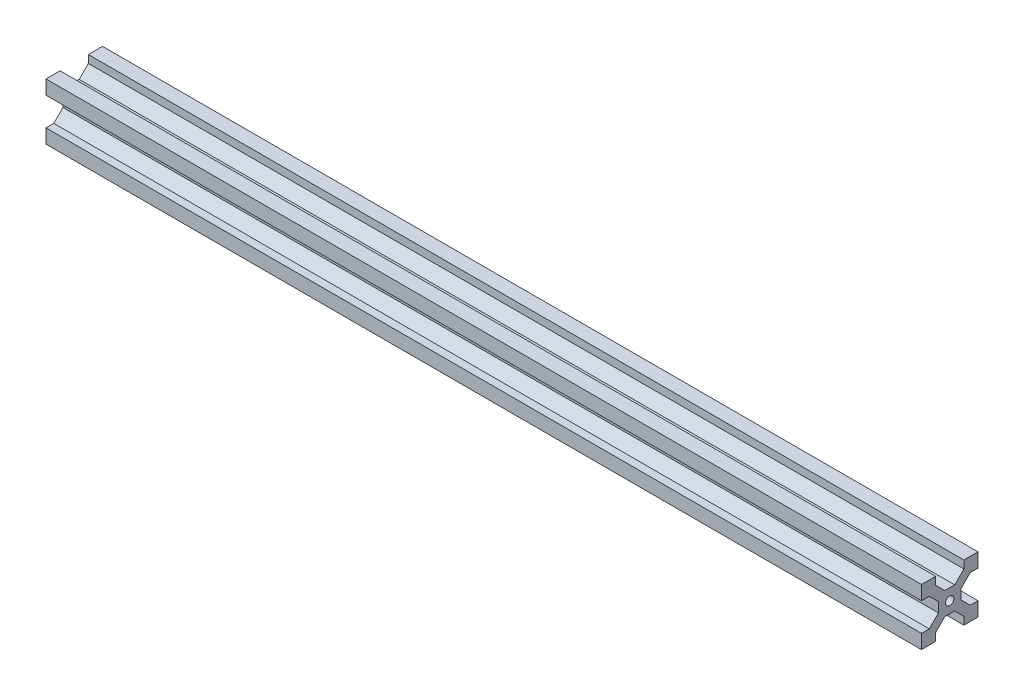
ISO-10303-21;
HEADER;
FILE_DESCRIPTION(('STEP AP214'),'2;1');
FILE_NAME('part.step','',(''),(''),'','','');
FILE_SCHEMA(('AUTOMOTIVE_DESIGN { 1 0 10303 214 1 1 1 1 }'));
ENDSEC;
DATA;
#1=APPLICATION_CONTEXT('core data for automotive mechanical design processes');
#2=APPLICATION_PROTOCOL_DEFINITION('international standard','automotive_design',2000,#1);
#3=PRODUCT_CONTEXT('',#1,'mechanical');
#4=PRODUCT('Part','Part','',(#3));
#5=PRODUCT_RELATED_PRODUCT_CATEGORY('part','',(#4));
#6=PRODUCT_DEFINITION_FORMATION('','',#4);
#7=PRODUCT_DEFINITION_CONTEXT('part definition',#1,'design');
#8=PRODUCT_DEFINITION('design','',#6,#7);
#9=PRODUCT_DEFINITION_SHAPE('','',#8);
#10=(LENGTH_UNIT() NAMED_UNIT(*) SI_UNIT(.MILLI.,.METRE.));
#11=(NAMED_UNIT(*) PLANE_ANGLE_UNIT() SI_UNIT($,.RADIAN.));
#12=(NAMED_UNIT(*) SI_UNIT($,.STERADIAN.) SOLID_ANGLE_UNIT());
#13=UNCERTAINTY_MEASURE_WITH_UNIT(LENGTH_MEASURE(1.E-05),#10,'distance_accuracy_value','');
#14=(GEOMETRIC_REPRESENTATION_CONTEXT(3) GLOBAL_UNCERTAINTY_ASSIGNED_CONTEXT((#13)) GLOBAL_UNIT_ASSIGNED_CONTEXT((#10,
#11,#12)) REPRESENTATION_CONTEXT('',''));
#15=CARTESIAN_POINT('',(0.,0.,0.));
#16=DIRECTION('',(0.,0.,1.));
#17=DIRECTION('',(1.,0.,0.));
#18=AXIS2_PLACEMENT_3D('',#15,#16,#17);
#19=CARTESIAN_POINT('',(155.,0.,0.));
#20=DIRECTION('',(-1.,0.,0.));
#21=DIRECTION('',(0.,0.,1.));
#22=AXIS2_PLACEMENT_3D('',#19,#20,#21);
#23=PLANE('',#22);
#24=DIRECTION('',(0.,0.,1.));
#25=VECTOR('',#24,1.);
#26=CARTESIAN_POINT('',(155.,10.,10.));
#27=LINE('',#26,#25);
#28=CARTESIAN_POINT('',(155.,10.,5.));
#29=VERTEX_POINT('',#28);
#30=CARTESIAN_POINT('',(155.,10.,10.));
#31=VERTEX_POINT('',#30);
#32=EDGE_CURVE('E307',#29,#31,#27,.T.);
#33=ORIENTED_EDGE('',*,*,#32,.T.);
#34=DIRECTION('',(0.,-1.,0.));
#35=VECTOR('',#34,1.);
#36=CARTESIAN_POINT('',(155.,5.,10.));
#37=LINE('',#36,#35);
#38=CARTESIAN_POINT('',(155.,5.,10.));
#39=VERTEX_POINT('',#38);
#40=EDGE_CURVE('E155',#31,#39,#37,.T.);
#41=ORIENTED_EDGE('',*,*,#40,.T.);
#42=DIRECTION('',(0.,0.,-1.));
#43=VECTOR('',#42,1.);
#44=CARTESIAN_POINT('',(155.,5.,10.));
#45=LINE('',#44,#43);
#46=CARTESIAN_POINT('',(155.,5.,7.25));
#47=VERTEX_POINT('',#46);
#48=EDGE_CURVE('E382',#39,#47,#45,.T.);
#49=ORIENTED_EDGE('',*,*,#48,.T.);
#50=DIRECTION('',(0.,-0.707106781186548,-0.707106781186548));
#51=VECTOR('',#50,1.);
#52=CARTESIAN_POINT('',(155.,1.75,4.));
#53=LINE('',#52,#51);
#54=CARTESIAN_POINT('',(155.,1.75,4.));
#55=VERTEX_POINT('',#54);
#56=EDGE_CURVE('E401',#47,#55,#53,.T.);
#57=ORIENTED_EDGE('',*,*,#56,.T.);
#58=DIRECTION('',(0.,-1.,0.));
#59=VECTOR('',#58,1.);
#60=CARTESIAN_POINT('',(155.,-1.75,4.));
#61=LINE('',#60,#59);
#62=CARTESIAN_POINT('',(155.,-1.75,4.));
#63=VERTEX_POINT('',#62);
#64=EDGE_CURVE('E398',#55,#63,#61,.T.);
#65=ORIENTED_EDGE('',*,*,#64,.T.);
#66=DIRECTION('',(0.,-0.707106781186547,0.707106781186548));
#67=VECTOR('',#66,1.);
#68=CARTESIAN_POINT('',(155.,-1.75,4.));
#69=LINE('',#68,#67);
#70=CARTESIAN_POINT('',(155.,-5.,7.25));
#71=VERTEX_POINT('',#70);
#72=EDGE_CURVE('E400',#63,#71,#69,.T.);
#73=ORIENTED_EDGE('',*,*,#72,.T.);
#74=DIRECTION('',(0.,0.,1.));
#75=VECTOR('',#74,1.);
#76=CARTESIAN_POINT('',(155.,-5.,10.));
#77=LINE('',#76,#75);
#78=CARTESIAN_POINT('',(155.,-5.,10.));
#79=VERTEX_POINT('',#78);
#80=EDGE_CURVE('E403',#71,#79,#77,.T.);
#81=ORIENTED_EDGE('',*,*,#80,.T.);
#82=DIRECTION('',(0.,-1.,0.));
#83=VECTOR('',#82,1.);
#84=CARTESIAN_POINT('',(155.,-5.,10.));
#85=LINE('',#84,#83);
#86=CARTESIAN_POINT('',(155.,-10.,10.));
#87=VERTEX_POINT('',#86);
#88=EDGE_CURVE('E409',#79,#87,#85,.T.);
#89=ORIENTED_EDGE('',*,*,#88,.T.);
#90=DIRECTION('',(0.,0.,-1.));
#91=VECTOR('',#90,1.);
#92=CARTESIAN_POINT('',(155.,-10.,10.));
#93=LINE('',#92,#91);
#94=CARTESIAN_POINT('',(155.,-10.,5.));
#95=VERTEX_POINT('',#94);
#96=EDGE_CURVE('E411',#87,#95,#93,.T.);
#97=ORIENTED_EDGE('',*,*,#96,.T.);
#98=DIRECTION('',(0.,1.,0.));
#99=VECTOR('',#98,1.);
#100=CARTESIAN_POINT('',(155.,-10.,5.));
#101=LINE('',#100,#99);
#102=CARTESIAN_POINT('',(155.,-7.25,5.));
#103=VERTEX_POINT('',#102);
#104=EDGE_CURVE('E413',#95,#103,#101,.T.);
#105=ORIENTED_EDGE('',*,*,#104,.T.);
#106=DIRECTION('',(0.,0.707106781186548,-0.707106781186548));
#107=VECTOR('',#106,1.);
#108=CARTESIAN_POINT('',(155.,-7.25,5.));
#109=LINE('',#108,#107);
#110=CARTESIAN_POINT('',(155.,-4.,1.75));
#111=VERTEX_POINT('',#110);
#112=EDGE_CURVE('E415',#103,#111,#109,.T.);
#113=ORIENTED_EDGE('',*,*,#112,.T.);
#114=DIRECTION('',(0.,0.,-1.));
#115=VECTOR('',#114,1.);
#116=CARTESIAN_POINT('',(155.,-4.,1.75));
#117=LINE('',#116,#115);
#118=CARTESIAN_POINT('',(155.,-4.,-1.75));
#119=VERTEX_POINT('',#118);
#120=EDGE_CURVE('E417',#111,#119,#117,.T.);
#121=ORIENTED_EDGE('',*,*,#120,.T.);
#122=DIRECTION('',(0.,-0.707106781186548,-0.707106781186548));
#123=VECTOR('',#122,1.);
#124=CARTESIAN_POINT('',(155.,-7.25,-5.));
#125=LINE('',#124,#123);
#126=CARTESIAN_POINT('',(155.,-7.25,-5.));
#127=VERTEX_POINT('',#126);
#128=EDGE_CURVE('E419',#119,#127,#125,.T.);
#129=ORIENTED_EDGE('',*,*,#128,.T.);
#130=DIRECTION('',(0.,-1.,0.));
#131=VECTOR('',#130,1.);
#132=CARTESIAN_POINT('',(155.,-10.,-5.));
#133=LINE('',#132,#131);
#134=CARTESIAN_POINT('',(155.,-10.,-5.));
#135=VERTEX_POINT('',#134);
#136=EDGE_CURVE('E421',#127,#135,#133,.T.);
#137=ORIENTED_EDGE('',*,*,#136,.T.);
#138=DIRECTION('',(0.,0.,-1.));
#139=VECTOR('',#138,1.);
#140=CARTESIAN_POINT('',(155.,-10.,-5.));
#141=LINE('',#140,#139);
#142=CARTESIAN_POINT('',(155.,-10.,-10.));
#143=VERTEX_POINT('',#142);
#144=EDGE_CURVE('E423',#135,#143,#141,.T.);
#145=ORIENTED_EDGE('',*,*,#144,.T.);
#146=DIRECTION('',(0.,1.,0.));
#147=VECTOR('',#146,1.);
#148=CARTESIAN_POINT('',(155.,-10.,-10.));
#149=LINE('',#148,#147);
#150=CARTESIAN_POINT('',(155.,-5.,-10.));
#151=VERTEX_POINT('',#150);
#152=EDGE_CURVE('E425',#143,#151,#149,.T.);
#153=ORIENTED_EDGE('',*,*,#152,.T.);
#154=DIRECTION('',(0.,0.,1.));
#155=VECTOR('',#154,1.);
#156=CARTESIAN_POINT('',(155.,-5.,-10.));
#157=LINE('',#156,#155);
#158=CARTESIAN_POINT('',(155.,-5.,-7.25));
#159=VERTEX_POINT('',#158);
#160=EDGE_CURVE('E427',#151,#159,#157,.T.);
#161=ORIENTED_EDGE('',*,*,#160,.T.);
#162=DIRECTION('',(0.,0.707106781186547,0.707106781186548));
#163=VECTOR('',#162,1.);
#164=CARTESIAN_POINT('',(155.,-1.75,-4.));
#165=LINE('',#164,#163);
#166=CARTESIAN_POINT('',(155.,-1.75,-4.));
#167=VERTEX_POINT('',#166);
#168=EDGE_CURVE('E429',#159,#167,#165,.T.);
#169=ORIENTED_EDGE('',*,*,#168,.T.);
#170=DIRECTION('',(0.,1.,0.));
#171=VECTOR('',#170,1.);
#172=CARTESIAN_POINT('',(155.,-1.75,-4.));
#173=LINE('',#172,#171);
#174=CARTESIAN_POINT('',(155.,1.75,-4.));
#175=VERTEX_POINT('',#174);
#176=EDGE_CURVE('E431',#167,#175,#173,.T.);
#177=ORIENTED_EDGE('',*,*,#176,.T.);
#178=DIRECTION('',(0.,0.707106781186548,-0.707106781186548));
#179=VECTOR('',#178,1.);
#180=CARTESIAN_POINT('',(155.,1.75,-4.));
#181=LINE('',#180,#179);
#182=CARTESIAN_POINT('',(155.,5.,-7.25));
#183=VERTEX_POINT('',#182);
#184=EDGE_CURVE('E433',#175,#183,#181,.T.);
#185=ORIENTED_EDGE('',*,*,#184,.T.);
#186=DIRECTION('',(0.,0.,-1.));
#187=VECTOR('',#186,1.);
#188=CARTESIAN_POINT('',(155.,5.,-10.));
#189=LINE('',#188,#187);
#190=CARTESIAN_POINT('',(155.,5.,-10.));
#191=VERTEX_POINT('',#190);
#192=EDGE_CURVE('E435',#183,#191,#189,.T.);
#193=ORIENTED_EDGE('',*,*,#192,.T.);
#194=DIRECTION('',(0.,1.,0.));
#195=VECTOR('',#194,1.);
#196=CARTESIAN_POINT('',(155.,5.,-10.));
#197=LINE('',#196,#195);
#198=CARTESIAN_POINT('',(155.,10.,-10.));
#199=VERTEX_POINT('',#198);
#200=EDGE_CURVE('E437',#191,#199,#197,.T.);
#201=ORIENTED_EDGE('',*,*,#200,.T.);
#202=DIRECTION('',(0.,0.,1.));
#203=VECTOR('',#202,1.);
#204=CARTESIAN_POINT('',(155.,10.,-10.));
#205=LINE('',#204,#203);
#206=CARTESIAN_POINT('',(155.,10.,-5.));
#207=VERTEX_POINT('',#206);
#208=EDGE_CURVE('E439',#199,#207,#205,.T.);
#209=ORIENTED_EDGE('',*,*,#208,.T.);
#210=DIRECTION('',(0.,-1.,0.));
#211=VECTOR('',#210,1.);
#212=CARTESIAN_POINT('',(155.,10.,-5.));
#213=LINE('',#212,#211);
#214=CARTESIAN_POINT('',(155.,7.25,-5.));
#215=VERTEX_POINT('',#214);
#216=EDGE_CURVE('E441',#207,#215,#213,.T.);
#217=ORIENTED_EDGE('',*,*,#216,.T.);
#218=DIRECTION('',(0.,-0.707106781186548,0.707106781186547));
#219=VECTOR('',#218,1.);
#220=CARTESIAN_POINT('',(155.,7.25,-5.));
#221=LINE('',#220,#219);
#222=CARTESIAN_POINT('',(155.,4.,-1.75));
#223=VERTEX_POINT('',#222);
#224=EDGE_CURVE('E234',#215,#223,#221,.T.);
#225=ORIENTED_EDGE('',*,*,#224,.T.);
#226=DIRECTION('',(0.,0.,1.));
#227=VECTOR('',#226,1.);
#228=CARTESIAN_POINT('',(155.,4.,-1.75));
#229=LINE('',#228,#227);
#230=CARTESIAN_POINT('',(155.,4.,1.75));
#231=VERTEX_POINT('',#230);
#232=EDGE_CURVE('E228',#223,#231,#229,.T.);
#233=ORIENTED_EDGE('',*,*,#232,.T.);
#234=DIRECTION('',(0.,0.707106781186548,0.707106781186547));
#235=VECTOR('',#234,1.);
#236=CARTESIAN_POINT('',(155.,7.25,5.));
#237=LINE('',#236,#235);
#238=CARTESIAN_POINT('',(155.,7.25,5.));
#239=VERTEX_POINT('',#238);
#240=EDGE_CURVE('E232',#231,#239,#237,.T.);
#241=ORIENTED_EDGE('',*,*,#240,.T.);
#242=DIRECTION('',(0.,1.,0.));
#243=VECTOR('',#242,1.);
#244=CARTESIAN_POINT('',(155.,10.,5.));
#245=LINE('',#244,#243);
#246=EDGE_CURVE('E52',#239,#29,#245,.T.);
#247=ORIENTED_EDGE('',*,*,#246,.T.);
#248=EDGE_LOOP('',(#33,#41,#49,#57,#65,#73,#81,#89,#97,#105,#113,#121,#129,#137,#145,#153,#161,
#169,#177,#185,#193,#201,#209,#217,#225,#233,#241,#247));
#249=FACE_BOUND('',#248,.T.);
#250=CARTESIAN_POINT('',(155.,0.,0.));
#251=DIRECTION('',(1.,0.,0.));
#252=DIRECTION('',(0.,0.,-1.));
#253=AXIS2_PLACEMENT_3D('',#250,#251,#252);
#254=CIRCLE('',#253,1.5);
#255=CARTESIAN_POINT('',(155.,0.,-1.5));
#256=VERTEX_POINT('',#255);
#257=EDGE_CURVE('E255',#256,#256,#254,.T.);
#258=ORIENTED_EDGE('',*,*,#257,.F.);
#259=EDGE_LOOP('',(#258));
#260=FACE_BOUND('',#259,.T.);
#261=ADVANCED_FACE('F35',(#249,#260),#23,.F.);
#262=CARTESIAN_POINT('',(-155.,0.,0.));
#263=DIRECTION('',(-1.,0.,0.));
#264=DIRECTION('',(0.,0.,1.));
#265=AXIS2_PLACEMENT_3D('',#262,#263,#264);
#266=PLANE('',#265);
#267=DIRECTION('',(0.,0.,1.));
#268=VECTOR('',#267,1.);
#269=CARTESIAN_POINT('',(-155.,10.,10.));
#270=LINE('',#269,#268);
#271=CARTESIAN_POINT('',(-155.,10.,5.));
#272=VERTEX_POINT('',#271);
#273=CARTESIAN_POINT('',(-155.,10.,10.));
#274=VERTEX_POINT('',#273);
#275=EDGE_CURVE('E251',#272,#274,#270,.T.);
#276=ORIENTED_EDGE('',*,*,#275,.F.);
#277=DIRECTION('',(0.,1.,0.));
#278=VECTOR('',#277,1.);
#279=CARTESIAN_POINT('',(-155.,10.,5.));
#280=LINE('',#279,#278);
#281=CARTESIAN_POINT('',(-155.,7.25,5.));
#282=VERTEX_POINT('',#281);
#283=EDGE_CURVE('E147',#282,#272,#280,.T.);
#284=ORIENTED_EDGE('',*,*,#283,.F.);
#285=DIRECTION('',(0.,0.707106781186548,0.707106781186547));
#286=VECTOR('',#285,1.);
#287=CARTESIAN_POINT('',(-155.,7.25,5.));
#288=LINE('',#287,#286);
#289=CARTESIAN_POINT('',(-155.,4.,1.75));
#290=VERTEX_POINT('',#289);
#291=EDGE_CURVE('E141',#290,#282,#288,.T.);
#292=ORIENTED_EDGE('',*,*,#291,.F.);
#293=DIRECTION('',(0.,0.,1.));
#294=VECTOR('',#293,1.);
#295=CARTESIAN_POINT('',(-155.,4.,1.75));
#296=LINE('',#295,#294);
#297=CARTESIAN_POINT('',(-155.,4.,-1.75));
#298=VERTEX_POINT('',#297);
#299=EDGE_CURVE('E241',#298,#290,#296,.T.);
#300=ORIENTED_EDGE('',*,*,#299,.F.);
#301=DIRECTION('',(0.,-0.707106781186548,0.707106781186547));
#302=VECTOR('',#301,1.);
#303=CARTESIAN_POINT('',(-155.,7.25,-5.));
#304=LINE('',#303,#302);
#305=CARTESIAN_POINT('',(-155.,7.25,-5.));
#306=VERTEX_POINT('',#305);
#307=EDGE_CURVE('E301',#306,#298,#304,.T.);
#308=ORIENTED_EDGE('',*,*,#307,.F.);
#309=DIRECTION('',(0.,-1.,0.));
#310=VECTOR('',#309,1.);
#311=CARTESIAN_POINT('',(-155.,10.,-5.));
#312=LINE('',#311,#310);
#313=CARTESIAN_POINT('',(-155.,10.,-5.));
#314=VERTEX_POINT('',#313);
#315=EDGE_CURVE('E299',#314,#306,#312,.T.);
#316=ORIENTED_EDGE('',*,*,#315,.F.);
#317=DIRECTION('',(0.,0.,1.));
#318=VECTOR('',#317,1.);
#319=CARTESIAN_POINT('',(-155.,10.,-10.));
#320=LINE('',#319,#318);
#321=CARTESIAN_POINT('',(-155.,10.,-10.));
#322=VERTEX_POINT('',#321);
#323=EDGE_CURVE('E297',#322,#314,#320,.T.);
#324=ORIENTED_EDGE('',*,*,#323,.F.);
#325=DIRECTION('',(0.,1.,0.));
#326=VECTOR('',#325,1.);
#327=CARTESIAN_POINT('',(-155.,5.,-10.));
#328=LINE('',#327,#326);
#329=CARTESIAN_POINT('',(-155.,5.,-10.));
#330=VERTEX_POINT('',#329);
#331=EDGE_CURVE('E295',#330,#322,#328,.T.);
#332=ORIENTED_EDGE('',*,*,#331,.F.);
#333=DIRECTION('',(0.,0.,-1.));
#334=VECTOR('',#333,1.);
#335=CARTESIAN_POINT('',(-155.,5.,-10.));
#336=LINE('',#335,#334);
#337=CARTESIAN_POINT('',(-155.,5.,-7.25));
#338=VERTEX_POINT('',#337);
#339=EDGE_CURVE('E293',#338,#330,#336,.T.);
#340=ORIENTED_EDGE('',*,*,#339,.F.);
#341=DIRECTION('',(0.,0.707106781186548,-0.707106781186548));
#342=VECTOR('',#341,1.);
#343=CARTESIAN_POINT('',(-155.,1.75,-4.));
#344=LINE('',#343,#342);
#345=CARTESIAN_POINT('',(-155.,1.75,-4.));
#346=VERTEX_POINT('',#345);
#347=EDGE_CURVE('E291',#346,#338,#344,.T.);
#348=ORIENTED_EDGE('',*,*,#347,.F.);
#349=DIRECTION('',(0.,1.,0.));
#350=VECTOR('',#349,1.);
#351=CARTESIAN_POINT('',(-155.,-1.75,-4.));
#352=LINE('',#351,#350);
#353=CARTESIAN_POINT('',(-155.,-1.75,-4.));
#354=VERTEX_POINT('',#353);
#355=EDGE_CURVE('E289',#354,#346,#352,.T.);
#356=ORIENTED_EDGE('',*,*,#355,.F.);
#357=DIRECTION('',(0.,0.707106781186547,0.707106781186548));
#358=VECTOR('',#357,1.);
#359=CARTESIAN_POINT('',(-155.,-1.75,-4.));
#360=LINE('',#359,#358);
#361=CARTESIAN_POINT('',(-155.,-5.,-7.25));
#362=VERTEX_POINT('',#361);
#363=EDGE_CURVE('E287',#362,#354,#360,.T.);
#364=ORIENTED_EDGE('',*,*,#363,.F.);
#365=DIRECTION('',(0.,0.,1.));
#366=VECTOR('',#365,1.);
#367=CARTESIAN_POINT('',(-155.,-5.,-10.));
#368=LINE('',#367,#366);
#369=CARTESIAN_POINT('',(-155.,-5.,-10.));
#370=VERTEX_POINT('',#369);
#371=EDGE_CURVE('E285',#370,#362,#368,.T.);
#372=ORIENTED_EDGE('',*,*,#371,.F.);
#373=DIRECTION('',(0.,1.,0.));
#374=VECTOR('',#373,1.);
#375=CARTESIAN_POINT('',(-155.,-10.,-10.));
#376=LINE('',#375,#374);
#377=CARTESIAN_POINT('',(-155.,-10.,-10.));
#378=VERTEX_POINT('',#377);
#379=EDGE_CURVE('E283',#378,#370,#376,.T.);
#380=ORIENTED_EDGE('',*,*,#379,.F.);
#381=DIRECTION('',(0.,0.,-1.));
#382=VECTOR('',#381,1.);
#383=CARTESIAN_POINT('',(-155.,-10.,-5.));
#384=LINE('',#383,#382);
#385=CARTESIAN_POINT('',(-155.,-10.,-5.));
#386=VERTEX_POINT('',#385);
#387=EDGE_CURVE('E281',#386,#378,#384,.T.);
#388=ORIENTED_EDGE('',*,*,#387,.F.);
#389=DIRECTION('',(0.,-1.,0.));
#390=VECTOR('',#389,1.);
#391=CARTESIAN_POINT('',(-155.,-10.,-5.));
#392=LINE('',#391,#390);
#393=CARTESIAN_POINT('',(-155.,-7.25,-5.));
#394=VERTEX_POINT('',#393);
#395=EDGE_CURVE('E279',#394,#386,#392,.T.);
#396=ORIENTED_EDGE('',*,*,#395,.F.);
#397=DIRECTION('',(0.,-0.707106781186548,-0.707106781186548));
#398=VECTOR('',#397,1.);
#399=CARTESIAN_POINT('',(-155.,-7.25,-5.));
#400=LINE('',#399,#398);
#401=CARTESIAN_POINT('',(-155.,-4.,-1.75));
#402=VERTEX_POINT('',#401);
#403=EDGE_CURVE('E277',#402,#394,#400,.T.);
#404=ORIENTED_EDGE('',*,*,#403,.F.);
#405=DIRECTION('',(0.,0.,-1.));
#406=VECTOR('',#405,1.);
#407=CARTESIAN_POINT('',(-155.,-4.,1.75));
#408=LINE('',#407,#406);
#409=CARTESIAN_POINT('',(-155.,-4.,1.75));
#410=VERTEX_POINT('',#409);
#411=EDGE_CURVE('E275',#410,#402,#408,.T.);
#412=ORIENTED_EDGE('',*,*,#411,.F.);
#413=DIRECTION('',(0.,0.707106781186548,-0.707106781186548));
#414=VECTOR('',#413,1.);
#415=CARTESIAN_POINT('',(-155.,-7.25,5.));
#416=LINE('',#415,#414);
#417=CARTESIAN_POINT('',(-155.,-7.25,5.));
#418=VERTEX_POINT('',#417);
#419=EDGE_CURVE('E273',#418,#410,#416,.T.);
#420=ORIENTED_EDGE('',*,*,#419,.F.);
#421=DIRECTION('',(0.,1.,0.));
#422=VECTOR('',#421,1.);
#423=CARTESIAN_POINT('',(-155.,-10.,5.));
#424=LINE('',#423,#422);
#425=CARTESIAN_POINT('',(-155.,-10.,5.));
#426=VERTEX_POINT('',#425);
#427=EDGE_CURVE('E271',#426,#418,#424,.T.);
#428=ORIENTED_EDGE('',*,*,#427,.F.);
#429=DIRECTION('',(0.,0.,-1.));
#430=VECTOR('',#429,1.);
#431=CARTESIAN_POINT('',(-155.,-10.,10.));
#432=LINE('',#431,#430);
#433=CARTESIAN_POINT('',(-155.,-10.,10.));
#434=VERTEX_POINT('',#433);
#435=EDGE_CURVE('E269',#434,#426,#432,.T.);
#436=ORIENTED_EDGE('',*,*,#435,.F.);
#437=DIRECTION('',(0.,-1.,0.));
#438=VECTOR('',#437,1.);
#439=CARTESIAN_POINT('',(-155.,-5.,10.));
#440=LINE('',#439,#438);
#441=CARTESIAN_POINT('',(-155.,-5.,10.));
#442=VERTEX_POINT('',#441);
#443=EDGE_CURVE('E267',#442,#434,#440,.T.);
#444=ORIENTED_EDGE('',*,*,#443,.F.);
#445=DIRECTION('',(0.,0.,1.));
#446=VECTOR('',#445,1.);
#447=CARTESIAN_POINT('',(-155.,-5.,10.));
#448=LINE('',#447,#446);
#449=CARTESIAN_POINT('',(-155.,-5.,7.25));
#450=VERTEX_POINT('',#449);
#451=EDGE_CURVE('E265',#450,#442,#448,.T.);
#452=ORIENTED_EDGE('',*,*,#451,.F.);
#453=DIRECTION('',(0.,-0.707106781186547,0.707106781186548));
#454=VECTOR('',#453,1.);
#455=CARTESIAN_POINT('',(-155.,-1.75,4.));
#456=LINE('',#455,#454);
#457=CARTESIAN_POINT('',(-155.,-1.75,4.));
#458=VERTEX_POINT('',#457);
#459=EDGE_CURVE('E263',#458,#450,#456,.T.);
#460=ORIENTED_EDGE('',*,*,#459,.F.);
#461=DIRECTION('',(0.,-1.,0.));
#462=VECTOR('',#461,1.);
#463=CARTESIAN_POINT('',(-155.,-1.75,4.));
#464=LINE('',#463,#462);
#465=CARTESIAN_POINT('',(-155.,1.75,4.));
#466=VERTEX_POINT('',#465);
#467=EDGE_CURVE('E261',#466,#458,#464,.T.);
#468=ORIENTED_EDGE('',*,*,#467,.F.);
#469=DIRECTION('',(0.,-0.707106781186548,-0.707106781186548));
#470=VECTOR('',#469,1.);
#471=CARTESIAN_POINT('',(-155.,1.75,4.));
#472=LINE('',#471,#470);
#473=CARTESIAN_POINT('',(-155.,5.,7.25));
#474=VERTEX_POINT('',#473);
#475=EDGE_CURVE('E259',#474,#466,#472,.T.);
#476=ORIENTED_EDGE('',*,*,#475,.F.);
#477=DIRECTION('',(0.,0.,-1.));
#478=VECTOR('',#477,1.);
#479=CARTESIAN_POINT('',(-155.,5.,10.));
#480=LINE('',#479,#478);
#481=CARTESIAN_POINT('',(-155.,5.,10.));
#482=VERTEX_POINT('',#481);
#483=EDGE_CURVE('E257',#482,#474,#480,.T.);
#484=ORIENTED_EDGE('',*,*,#483,.F.);
#485=DIRECTION('',(0.,-1.,0.));
#486=VECTOR('',#485,1.);
#487=CARTESIAN_POINT('',(-155.,5.,10.));
#488=LINE('',#487,#486);
#489=EDGE_CURVE('E254',#274,#482,#488,.T.);
#490=ORIENTED_EDGE('',*,*,#489,.F.);
#491=EDGE_LOOP('',(#276,#284,#292,#300,#308,#316,#324,#332,#340,#348,#356,#364,#372,#380,#388,
#396,#404,#412,#420,#428,#436,#444,#452,#460,#468,#476,#484,#490));
#492=FACE_BOUND('',#491,.T.);
#493=CARTESIAN_POINT('',(-155.,0.,0.));
#494=DIRECTION('',(1.,0.,0.));
#495=DIRECTION('',(0.,0.,-1.));
#496=AXIS2_PLACEMENT_3D('',#493,#494,#495);
#497=CIRCLE('',#496,1.5);
#498=CARTESIAN_POINT('',(-155.,0.,-1.5));
#499=VERTEX_POINT('',#498);
#500=EDGE_CURVE('E799',#499,#499,#497,.T.);
#501=ORIENTED_EDGE('',*,*,#500,.T.);
#502=EDGE_LOOP('',(#501));
#503=FACE_BOUND('',#502,.T.);
#504=ADVANCED_FACE('F386',(#492,#503),#266,.T.);
#505=CARTESIAN_POINT('',(155.,10.,10.));
#506=DIRECTION('',(0.,-1.,0.));
#507=DIRECTION('',(0.,0.,-1.));
#508=AXIS2_PLACEMENT_3D('',#505,#506,#507);
#509=PLANE('',#508);
#510=ORIENTED_EDGE('',*,*,#275,.T.);
#511=DIRECTION('',(-1.,0.,0.));
#512=VECTOR('',#511,1.);
#513=CARTESIAN_POINT('',(155.,10.,10.));
#514=LINE('',#513,#512);
#515=EDGE_CURVE('E11',#31,#274,#514,.T.);
#516=ORIENTED_EDGE('',*,*,#515,.F.);
#517=ORIENTED_EDGE('',*,*,#32,.F.);
#518=DIRECTION('',(-1.,0.,0.));
#519=VECTOR('',#518,1.);
#520=CARTESIAN_POINT('',(155.,10.,5.));
#521=LINE('',#520,#519);
#522=EDGE_CURVE('E247',#29,#272,#521,.T.);
#523=ORIENTED_EDGE('',*,*,#522,.T.);
#524=EDGE_LOOP('',(#510,#516,#517,#523));
#525=FACE_BOUND('',#524,.T.);
#526=ADVANCED_FACE('F37',(#525),#509,.F.);
#527=CARTESIAN_POINT('',(155.,5.,10.));
#528=DIRECTION('',(0.,0.,-1.));
#529=DIRECTION('',(-1.,0.,0.));
#530=AXIS2_PLACEMENT_3D('',#527,#528,#529);
#531=PLANE('',#530);
#532=ORIENTED_EDGE('',*,*,#489,.T.);
#533=DIRECTION('',(-1.,0.,0.));
#534=VECTOR('',#533,1.);
#535=CARTESIAN_POINT('',(155.,5.,10.));
#536=LINE('',#535,#534);
#537=EDGE_CURVE('E44',#39,#482,#536,.T.);
#538=ORIENTED_EDGE('',*,*,#537,.F.);
#539=ORIENTED_EDGE('',*,*,#40,.F.);
#540=ORIENTED_EDGE('',*,*,#515,.T.);
#541=EDGE_LOOP('',(#532,#538,#539,#540));
#542=FACE_BOUND('',#541,.T.);
#543=ADVANCED_FACE('F476',(#542),#531,.F.);
#544=CARTESIAN_POINT('',(155.,5.,10.));
#545=DIRECTION('',(0.,1.,0.));
#546=DIRECTION('',(0.,0.,1.));
#547=AXIS2_PLACEMENT_3D('',#544,#545,#546);
#548=PLANE('',#547);
#549=ORIENTED_EDGE('',*,*,#483,.T.);
#550=DIRECTION('',(-1.,0.,0.));
#551=VECTOR('',#550,1.);
#552=CARTESIAN_POINT('',(155.,5.,7.25));
#553=LINE('',#552,#551);
#554=EDGE_CURVE('E374',#47,#474,#553,.T.);
#555=ORIENTED_EDGE('',*,*,#554,.F.);
#556=ORIENTED_EDGE('',*,*,#48,.F.);
#557=ORIENTED_EDGE('',*,*,#537,.T.);
#558=EDGE_LOOP('',(#549,#555,#556,#557));
#559=FACE_BOUND('',#558,.T.);
#560=ADVANCED_FACE('F380',(#559),#548,.F.);
#561=CARTESIAN_POINT('',(155.,1.75,4.));
#562=DIRECTION('',(0.,0.707106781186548,-0.707106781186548));
#563=DIRECTION('',(0.,0.707106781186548,0.707106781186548));
#564=AXIS2_PLACEMENT_3D('',#561,#562,#563);
#565=PLANE('',#564);
#566=ORIENTED_EDGE('',*,*,#475,.T.);
#567=DIRECTION('',(-1.,0.,0.));
#568=VECTOR('',#567,1.);
#569=CARTESIAN_POINT('',(155.,1.75,4.));
#570=LINE('',#569,#568);
#571=EDGE_CURVE('E371',#55,#466,#570,.T.);
#572=ORIENTED_EDGE('',*,*,#571,.F.);
#573=ORIENTED_EDGE('',*,*,#56,.F.);
#574=ORIENTED_EDGE('',*,*,#554,.T.);
#575=EDGE_LOOP('',(#566,#572,#573,#574));
#576=FACE_BOUND('',#575,.T.);
#577=ADVANCED_FACE('F392',(#576),#565,.F.);
#578=CARTESIAN_POINT('',(155.,-1.75,4.));
#579=DIRECTION('',(0.,0.,-1.));
#580=DIRECTION('',(-1.,0.,0.));
#581=AXIS2_PLACEMENT_3D('',#578,#579,#580);
#582=PLANE('',#581);
#583=ORIENTED_EDGE('',*,*,#467,.T.);
#584=DIRECTION('',(-1.,0.,0.));
#585=VECTOR('',#584,1.);
#586=CARTESIAN_POINT('',(155.,-1.75,4.));
#587=LINE('',#586,#585);
#588=EDGE_CURVE('E368',#63,#458,#587,.T.);
#589=ORIENTED_EDGE('',*,*,#588,.F.);
#590=ORIENTED_EDGE('',*,*,#64,.F.);
#591=ORIENTED_EDGE('',*,*,#571,.T.);
#592=EDGE_LOOP('',(#583,#589,#590,#591));
#593=FACE_BOUND('',#592,.T.);
#594=ADVANCED_FACE('F396',(#593),#582,.F.);
#595=CARTESIAN_POINT('',(155.,-1.75,4.));
#596=DIRECTION('',(0.,-0.707106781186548,-0.707106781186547));
#597=DIRECTION('',(0.,0.707106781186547,-0.707106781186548));
#598=AXIS2_PLACEMENT_3D('',#595,#596,#597);
#599=PLANE('',#598);
#600=ORIENTED_EDGE('',*,*,#459,.T.);
#601=DIRECTION('',(-1.,0.,0.));
#602=VECTOR('',#601,1.);
#603=CARTESIAN_POINT('',(155.,-5.,7.25));
#604=LINE('',#603,#602);
#605=EDGE_CURVE('E365',#71,#450,#604,.T.);
#606=ORIENTED_EDGE('',*,*,#605,.F.);
#607=ORIENTED_EDGE('',*,*,#72,.F.);
#608=ORIENTED_EDGE('',*,*,#588,.T.);
#609=EDGE_LOOP('',(#600,#606,#607,#608));
#610=FACE_BOUND('',#609,.T.);
#611=ADVANCED_FACE('F489',(#610),#599,.F.);
#612=CARTESIAN_POINT('',(155.,-5.,10.));
#613=DIRECTION('',(0.,-1.,0.));
#614=DIRECTION('',(0.,0.,-1.));
#615=AXIS2_PLACEMENT_3D('',#612,#613,#614);
#616=PLANE('',#615);
#617=ORIENTED_EDGE('',*,*,#451,.T.);
#618=DIRECTION('',(-1.,0.,0.));
#619=VECTOR('',#618,1.);
#620=CARTESIAN_POINT('',(155.,-5.,10.));
#621=LINE('',#620,#619);
#622=EDGE_CURVE('E362',#79,#442,#621,.T.);
#623=ORIENTED_EDGE('',*,*,#622,.F.);
#624=ORIENTED_EDGE('',*,*,#80,.F.);
#625=ORIENTED_EDGE('',*,*,#605,.T.);
#626=EDGE_LOOP('',(#617,#623,#624,#625));
#627=FACE_BOUND('',#626,.T.);
#628=ADVANCED_FACE('F492',(#627),#616,.F.);
#629=CARTESIAN_POINT('',(155.,-5.,10.));
#630=DIRECTION('',(0.,0.,-1.));
#631=DIRECTION('',(-1.,0.,0.));
#632=AXIS2_PLACEMENT_3D('',#629,#630,#631);
#633=PLANE('',#632);
#634=ORIENTED_EDGE('',*,*,#443,.T.);
#635=DIRECTION('',(-1.,0.,0.));
#636=VECTOR('',#635,1.);
#637=CARTESIAN_POINT('',(155.,-10.,10.));
#638=LINE('',#637,#636);
#639=EDGE_CURVE('E359',#87,#434,#638,.T.);
#640=ORIENTED_EDGE('',*,*,#639,.F.);
#641=ORIENTED_EDGE('',*,*,#88,.F.);
#642=ORIENTED_EDGE('',*,*,#622,.T.);
#643=EDGE_LOOP('',(#634,#640,#641,#642));
#644=FACE_BOUND('',#643,.T.);
#645=ADVANCED_FACE('F496',(#644),#633,.F.);
#646=CARTESIAN_POINT('',(155.,-10.,10.));
#647=DIRECTION('',(0.,1.,0.));
#648=DIRECTION('',(0.,0.,1.));
#649=AXIS2_PLACEMENT_3D('',#646,#647,#648);
#650=PLANE('',#649);
#651=ORIENTED_EDGE('',*,*,#435,.T.);
#652=DIRECTION('',(-1.,0.,0.));
#653=VECTOR('',#652,1.);
#654=CARTESIAN_POINT('',(155.,-10.,5.));
#655=LINE('',#654,#653);
#656=EDGE_CURVE('E356',#95,#426,#655,.T.);
#657=ORIENTED_EDGE('',*,*,#656,.F.);
#658=ORIENTED_EDGE('',*,*,#96,.F.);
#659=ORIENTED_EDGE('',*,*,#639,.T.);
#660=EDGE_LOOP('',(#651,#657,#658,#659));
#661=FACE_BOUND('',#660,.T.);
#662=ADVANCED_FACE('F500',(#661),#650,.F.);
#663=CARTESIAN_POINT('',(155.,-10.,5.));
#664=DIRECTION('',(0.,0.,1.));
#665=DIRECTION('',(0.,-1.,0.));
#666=AXIS2_PLACEMENT_3D('',#663,#664,#665);
#667=PLANE('',#666);
#668=ORIENTED_EDGE('',*,*,#427,.T.);
#669=DIRECTION('',(-1.,0.,0.));
#670=VECTOR('',#669,1.);
#671=CARTESIAN_POINT('',(155.,-7.25,5.));
#672=LINE('',#671,#670);
#673=EDGE_CURVE('E353',#103,#418,#672,.T.);
#674=ORIENTED_EDGE('',*,*,#673,.F.);
#675=ORIENTED_EDGE('',*,*,#104,.F.);
#676=ORIENTED_EDGE('',*,*,#656,.T.);
#677=EDGE_LOOP('',(#668,#674,#675,#676));
#678=FACE_BOUND('',#677,.T.);
#679=ADVANCED_FACE('F504',(#678),#667,.F.);
#680=CARTESIAN_POINT('',(155.,-7.25,5.));
#681=DIRECTION('',(0.,0.707106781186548,0.707106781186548));
#682=DIRECTION('',(0.,-0.707106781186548,0.707106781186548));
#683=AXIS2_PLACEMENT_3D('',#680,#681,#682);
#684=PLANE('',#683);
#685=ORIENTED_EDGE('',*,*,#419,.T.);
#686=DIRECTION('',(-1.,0.,0.));
#687=VECTOR('',#686,1.);
#688=CARTESIAN_POINT('',(155.,-4.,1.75));
#689=LINE('',#688,#687);
#690=EDGE_CURVE('E350',#111,#410,#689,.T.);
#691=ORIENTED_EDGE('',*,*,#690,.F.);
#692=ORIENTED_EDGE('',*,*,#112,.F.);
#693=ORIENTED_EDGE('',*,*,#673,.T.);
#694=EDGE_LOOP('',(#685,#691,#692,#693));
#695=FACE_BOUND('',#694,.T.);
#696=ADVANCED_FACE('F508',(#695),#684,.F.);
#697=CARTESIAN_POINT('',(155.,-4.,1.75));
#698=DIRECTION('',(0.,1.,0.));
#699=DIRECTION('',(0.,0.,1.));
#700=AXIS2_PLACEMENT_3D('',#697,#698,#699);
#701=PLANE('',#700);
#702=ORIENTED_EDGE('',*,*,#411,.T.);
#703=DIRECTION('',(-1.,0.,0.));
#704=VECTOR('',#703,1.);
#705=CARTESIAN_POINT('',(155.,-4.,-1.75));
#706=LINE('',#705,#704);
#707=EDGE_CURVE('E347',#119,#402,#706,.T.);
#708=ORIENTED_EDGE('',*,*,#707,.F.);
#709=ORIENTED_EDGE('',*,*,#120,.F.);
#710=ORIENTED_EDGE('',*,*,#690,.T.);
#711=EDGE_LOOP('',(#702,#708,#709,#710));
#712=FACE_BOUND('',#711,.T.);
#713=ADVANCED_FACE('F512',(#712),#701,.F.);
#714=CARTESIAN_POINT('',(155.,-7.25,-5.));
#715=DIRECTION('',(0.,0.707106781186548,-0.707106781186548));
#716=DIRECTION('',(0.,0.707106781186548,0.707106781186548));
#717=AXIS2_PLACEMENT_3D('',#714,#715,#716);
#718=PLANE('',#717);
#719=ORIENTED_EDGE('',*,*,#403,.T.);
#720=DIRECTION('',(-1.,0.,0.));
#721=VECTOR('',#720,1.);
#722=CARTESIAN_POINT('',(155.,-7.25,-5.));
#723=LINE('',#722,#721);
#724=EDGE_CURVE('E344',#127,#394,#723,.T.);
#725=ORIENTED_EDGE('',*,*,#724,.F.);
#726=ORIENTED_EDGE('',*,*,#128,.F.);
#727=ORIENTED_EDGE('',*,*,#707,.T.);
#728=EDGE_LOOP('',(#719,#725,#726,#727));
#729=FACE_BOUND('',#728,.T.);
#730=ADVANCED_FACE('F516',(#729),#718,.F.);
#731=CARTESIAN_POINT('',(155.,-10.,-5.));
#732=DIRECTION('',(0.,0.,-1.));
#733=DIRECTION('',(0.,1.,0.));
#734=AXIS2_PLACEMENT_3D('',#731,#732,#733);
#735=PLANE('',#734);
#736=ORIENTED_EDGE('',*,*,#395,.T.);
#737=DIRECTION('',(-1.,0.,0.));
#738=VECTOR('',#737,1.);
#739=CARTESIAN_POINT('',(155.,-10.,-5.));
#740=LINE('',#739,#738);
#741=EDGE_CURVE('E341',#135,#386,#740,.T.);
#742=ORIENTED_EDGE('',*,*,#741,.F.);
#743=ORIENTED_EDGE('',*,*,#136,.F.);
#744=ORIENTED_EDGE('',*,*,#724,.T.);
#745=EDGE_LOOP('',(#736,#742,#743,#744));
#746=FACE_BOUND('',#745,.T.);
#747=ADVANCED_FACE('F520',(#746),#735,.F.);
#748=CARTESIAN_POINT('',(155.,-10.,-5.));
#749=DIRECTION('',(0.,1.,0.));
#750=DIRECTION('',(0.,0.,1.));
#751=AXIS2_PLACEMENT_3D('',#748,#749,#750);
#752=PLANE('',#751);
#753=ORIENTED_EDGE('',*,*,#387,.T.);
#754=DIRECTION('',(-1.,0.,0.));
#755=VECTOR('',#754,1.);
#756=CARTESIAN_POINT('',(155.,-10.,-10.));
#757=LINE('',#756,#755);
#758=EDGE_CURVE('E338',#143,#378,#757,.T.);
#759=ORIENTED_EDGE('',*,*,#758,.F.);
#760=ORIENTED_EDGE('',*,*,#144,.F.);
#761=ORIENTED_EDGE('',*,*,#741,.T.);
#762=EDGE_LOOP('',(#753,#759,#760,#761));
#763=FACE_BOUND('',#762,.T.);
#764=ADVANCED_FACE('F524',(#763),#752,.F.);
#765=CARTESIAN_POINT('',(155.,-10.,-10.));
#766=DIRECTION('',(0.,0.,1.));
#767=DIRECTION('',(1.,0.,0.));
#768=AXIS2_PLACEMENT_3D('',#765,#766,#767);
#769=PLANE('',#768);
#770=ORIENTED_EDGE('',*,*,#379,.T.);
#771=DIRECTION('',(-1.,0.,0.));
#772=VECTOR('',#771,1.);
#773=CARTESIAN_POINT('',(155.,-5.,-10.));
#774=LINE('',#773,#772);
#775=EDGE_CURVE('E335',#151,#370,#774,.T.);
#776=ORIENTED_EDGE('',*,*,#775,.F.);
#777=ORIENTED_EDGE('',*,*,#152,.F.);
#778=ORIENTED_EDGE('',*,*,#758,.T.);
#779=EDGE_LOOP('',(#770,#776,#777,#778));
#780=FACE_BOUND('',#779,.T.);
#781=ADVANCED_FACE('F528',(#780),#769,.F.);
#782=CARTESIAN_POINT('',(155.,-5.,-10.));
#783=DIRECTION('',(0.,-1.,0.));
#784=DIRECTION('',(0.,0.,-1.));
#785=AXIS2_PLACEMENT_3D('',#782,#783,#784);
#786=PLANE('',#785);
#787=ORIENTED_EDGE('',*,*,#371,.T.);
#788=DIRECTION('',(-1.,0.,0.));
#789=VECTOR('',#788,1.);
#790=CARTESIAN_POINT('',(155.,-5.,-7.25));
#791=LINE('',#790,#789);
#792=EDGE_CURVE('E332',#159,#362,#791,.T.);
#793=ORIENTED_EDGE('',*,*,#792,.F.);
#794=ORIENTED_EDGE('',*,*,#160,.F.);
#795=ORIENTED_EDGE('',*,*,#775,.T.);
#796=EDGE_LOOP('',(#787,#793,#794,#795));
#797=FACE_BOUND('',#796,.T.);
#798=ADVANCED_FACE('F532',(#797),#786,.F.);
#799=CARTESIAN_POINT('',(155.,-1.75,-4.));
#800=DIRECTION('',(0.,-0.707106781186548,0.707106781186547));
#801=DIRECTION('',(0.,-0.707106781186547,-0.707106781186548));
#802=AXIS2_PLACEMENT_3D('',#799,#800,#801);
#803=PLANE('',#802);
#804=ORIENTED_EDGE('',*,*,#363,.T.);
#805=DIRECTION('',(-1.,0.,0.));
#806=VECTOR('',#805,1.);
#807=CARTESIAN_POINT('',(155.,-1.75,-4.));
#808=LINE('',#807,#806);
#809=EDGE_CURVE('E329',#167,#354,#808,.T.);
#810=ORIENTED_EDGE('',*,*,#809,.F.);
#811=ORIENTED_EDGE('',*,*,#168,.F.);
#812=ORIENTED_EDGE('',*,*,#792,.T.);
#813=EDGE_LOOP('',(#804,#810,#811,#812));
#814=FACE_BOUND('',#813,.T.);
#815=ADVANCED_FACE('F536',(#814),#803,.F.);
#816=CARTESIAN_POINT('',(155.,-1.75,-4.));
#817=DIRECTION('',(0.,0.,1.));
#818=DIRECTION('',(1.,0.,0.));
#819=AXIS2_PLACEMENT_3D('',#816,#817,#818);
#820=PLANE('',#819);
#821=ORIENTED_EDGE('',*,*,#355,.T.);
#822=DIRECTION('',(-1.,0.,0.));
#823=VECTOR('',#822,1.);
#824=CARTESIAN_POINT('',(155.,1.75,-4.));
#825=LINE('',#824,#823);
#826=EDGE_CURVE('E326',#175,#346,#825,.T.);
#827=ORIENTED_EDGE('',*,*,#826,.F.);
#828=ORIENTED_EDGE('',*,*,#176,.F.);
#829=ORIENTED_EDGE('',*,*,#809,.T.);
#830=EDGE_LOOP('',(#821,#827,#828,#829));
#831=FACE_BOUND('',#830,.T.);
#832=ADVANCED_FACE('F540',(#831),#820,.F.);
#833=CARTESIAN_POINT('',(155.,1.75,-4.));
#834=DIRECTION('',(0.,0.707106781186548,0.707106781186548));
#835=DIRECTION('',(0.,-0.707106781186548,0.707106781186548));
#836=AXIS2_PLACEMENT_3D('',#833,#834,#835);
#837=PLANE('',#836);
#838=ORIENTED_EDGE('',*,*,#347,.T.);
#839=DIRECTION('',(-1.,0.,0.));
#840=VECTOR('',#839,1.);
#841=CARTESIAN_POINT('',(155.,5.,-7.25));
#842=LINE('',#841,#840);
#843=EDGE_CURVE('E323',#183,#338,#842,.T.);
#844=ORIENTED_EDGE('',*,*,#843,.F.);
#845=ORIENTED_EDGE('',*,*,#184,.F.);
#846=ORIENTED_EDGE('',*,*,#826,.T.);
#847=EDGE_LOOP('',(#838,#844,#845,#846));
#848=FACE_BOUND('',#847,.T.);
#849=ADVANCED_FACE('F544',(#848),#837,.F.);
#850=CARTESIAN_POINT('',(155.,5.,-10.));
#851=DIRECTION('',(0.,1.,0.));
#852=DIRECTION('',(0.,0.,1.));
#853=AXIS2_PLACEMENT_3D('',#850,#851,#852);
#854=PLANE('',#853);
#855=ORIENTED_EDGE('',*,*,#339,.T.);
#856=DIRECTION('',(-1.,0.,0.));
#857=VECTOR('',#856,1.);
#858=CARTESIAN_POINT('',(155.,5.,-10.));
#859=LINE('',#858,#857);
#860=EDGE_CURVE('E320',#191,#330,#859,.T.);
#861=ORIENTED_EDGE('',*,*,#860,.F.);
#862=ORIENTED_EDGE('',*,*,#192,.F.);
#863=ORIENTED_EDGE('',*,*,#843,.T.);
#864=EDGE_LOOP('',(#855,#861,#862,#863));
#865=FACE_BOUND('',#864,.T.);
#866=ADVANCED_FACE('F548',(#865),#854,.F.);
#867=CARTESIAN_POINT('',(155.,5.,-10.));
#868=DIRECTION('',(0.,0.,1.));
#869=DIRECTION('',(0.,-1.,0.));
#870=AXIS2_PLACEMENT_3D('',#867,#868,#869);
#871=PLANE('',#870);
#872=ORIENTED_EDGE('',*,*,#331,.T.);
#873=DIRECTION('',(-1.,0.,0.));
#874=VECTOR('',#873,1.);
#875=CARTESIAN_POINT('',(155.,10.,-10.));
#876=LINE('',#875,#874);
#877=EDGE_CURVE('E317',#199,#322,#876,.T.);
#878=ORIENTED_EDGE('',*,*,#877,.F.);
#879=ORIENTED_EDGE('',*,*,#200,.F.);
#880=ORIENTED_EDGE('',*,*,#860,.T.);
#881=EDGE_LOOP('',(#872,#878,#879,#880));
#882=FACE_BOUND('',#881,.T.);
#883=ADVANCED_FACE('F552',(#882),#871,.F.);
#884=CARTESIAN_POINT('',(155.,10.,-10.));
#885=DIRECTION('',(0.,-1.,0.));
#886=DIRECTION('',(0.,0.,-1.));
#887=AXIS2_PLACEMENT_3D('',#884,#885,#886);
#888=PLANE('',#887);
#889=ORIENTED_EDGE('',*,*,#323,.T.);
#890=DIRECTION('',(-1.,0.,0.));
#891=VECTOR('',#890,1.);
#892=CARTESIAN_POINT('',(155.,10.,-5.));
#893=LINE('',#892,#891);
#894=EDGE_CURVE('E314',#207,#314,#893,.T.);
#895=ORIENTED_EDGE('',*,*,#894,.F.);
#896=ORIENTED_EDGE('',*,*,#208,.F.);
#897=ORIENTED_EDGE('',*,*,#877,.T.);
#898=EDGE_LOOP('',(#889,#895,#896,#897));
#899=FACE_BOUND('',#898,.T.);
#900=ADVANCED_FACE('F556',(#899),#888,.F.);
#901=CARTESIAN_POINT('',(155.,10.,-5.));
#902=DIRECTION('',(0.,0.,-1.));
#903=DIRECTION('',(-1.,0.,0.));
#904=AXIS2_PLACEMENT_3D('',#901,#902,#903);
#905=PLANE('',#904);
#906=ORIENTED_EDGE('',*,*,#315,.T.);
#907=DIRECTION('',(-1.,0.,0.));
#908=VECTOR('',#907,1.);
#909=CARTESIAN_POINT('',(155.,7.25,-5.));
#910=LINE('',#909,#908);
#911=EDGE_CURVE('E311',#215,#306,#910,.T.);
#912=ORIENTED_EDGE('',*,*,#911,.F.);
#913=ORIENTED_EDGE('',*,*,#216,.F.);
#914=ORIENTED_EDGE('',*,*,#894,.T.);
#915=EDGE_LOOP('',(#906,#912,#913,#914));
#916=FACE_BOUND('',#915,.T.);
#917=ADVANCED_FACE('F447',(#916),#905,.F.);
#918=CARTESIAN_POINT('',(155.,7.25,-5.));
#919=DIRECTION('',(0.,-0.707106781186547,-0.707106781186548));
#920=DIRECTION('',(0.,0.707106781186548,-0.707106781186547));
#921=AXIS2_PLACEMENT_3D('',#918,#919,#920);
#922=PLANE('',#921);
#923=ORIENTED_EDGE('',*,*,#307,.T.);
#924=DIRECTION('',(-1.,0.,0.));
#925=VECTOR('',#924,1.);
#926=CARTESIAN_POINT('',(155.,4.,-1.75));
#927=LINE('',#926,#925);
#928=EDGE_CURVE('E242',#223,#298,#927,.T.);
#929=ORIENTED_EDGE('',*,*,#928,.F.);
#930=ORIENTED_EDGE('',*,*,#224,.F.);
#931=ORIENTED_EDGE('',*,*,#911,.T.);
#932=EDGE_LOOP('',(#923,#929,#930,#931));
#933=FACE_BOUND('',#932,.T.);
#934=ADVANCED_FACE('F451',(#933),#922,.F.);
#935=CARTESIAN_POINT('',(155.,4.,1.75));
#936=DIRECTION('',(0.,-1.,0.));
#937=DIRECTION('',(0.,0.,-1.));
#938=AXIS2_PLACEMENT_3D('',#935,#936,#937);
#939=PLANE('',#938);
#940=ORIENTED_EDGE('',*,*,#299,.T.);
#941=DIRECTION('',(-1.,0.,0.));
#942=VECTOR('',#941,1.);
#943=CARTESIAN_POINT('',(155.,4.,1.75));
#944=LINE('',#943,#942);
#945=EDGE_CURVE('E239',#231,#290,#944,.T.);
#946=ORIENTED_EDGE('',*,*,#945,.F.);
#947=ORIENTED_EDGE('',*,*,#232,.F.);
#948=ORIENTED_EDGE('',*,*,#928,.T.);
#949=EDGE_LOOP('',(#940,#946,#947,#948));
#950=FACE_BOUND('',#949,.T.);
#951=ADVANCED_FACE('F240',(#950),#939,.F.);
#952=CARTESIAN_POINT('',(155.,7.25,5.));
#953=DIRECTION('',(0.,-0.707106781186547,0.707106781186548));
#954=DIRECTION('',(0.,-0.707106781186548,-0.707106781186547));
#955=AXIS2_PLACEMENT_3D('',#952,#953,#954);
#956=PLANE('',#955);
#957=ORIENTED_EDGE('',*,*,#291,.T.);
#958=DIRECTION('',(-1.,0.,0.));
#959=VECTOR('',#958,1.);
#960=CARTESIAN_POINT('',(155.,7.25,5.));
#961=LINE('',#960,#959);
#962=EDGE_CURVE('E243',#239,#282,#961,.T.);
#963=ORIENTED_EDGE('',*,*,#962,.F.);
#964=ORIENTED_EDGE('',*,*,#240,.F.);
#965=ORIENTED_EDGE('',*,*,#945,.T.);
#966=EDGE_LOOP('',(#957,#963,#964,#965));
#967=FACE_BOUND('',#966,.T.);
#968=ADVANCED_FACE('F245',(#967),#956,.F.);
#969=CARTESIAN_POINT('',(155.,10.,5.));
#970=DIRECTION('',(0.,0.,1.));
#971=DIRECTION('',(1.,0.,0.));
#972=AXIS2_PLACEMENT_3D('',#969,#970,#971);
#973=PLANE('',#972);
#974=ORIENTED_EDGE('',*,*,#283,.T.);
#975=ORIENTED_EDGE('',*,*,#522,.F.);
#976=ORIENTED_EDGE('',*,*,#246,.F.);
#977=ORIENTED_EDGE('',*,*,#962,.T.);
#978=EDGE_LOOP('',(#974,#975,#976,#977));
#979=FACE_BOUND('',#978,.T.);
#980=ADVANCED_FACE('F456',(#979),#973,.F.);
#981=CARTESIAN_POINT('',(155.,0.,0.));
#982=DIRECTION('',(-1.,0.,0.));
#983=DIRECTION('',(0.,0.,1.));
#984=AXIS2_PLACEMENT_3D('',#981,#982,#983);
#985=CYLINDRICAL_SURFACE('',#984,1.5);
#986=ORIENTED_EDGE('',*,*,#257,.T.);
#987=EDGE_LOOP('',(#986));
#988=FACE_BOUND('',#987,.T.);
#989=ORIENTED_EDGE('',*,*,#500,.F.);
#990=EDGE_LOOP('',(#989));
#991=FACE_BOUND('',#990,.T.);
#992=ADVANCED_FACE('F458',(#988,#991),#985,.F.);
#993=CLOSED_SHELL('',(#261,#504,#526,#543,#560,#577,#594,#611,#628,#645,#662,#679,#696,#713,
#730,#747,#764,#781,#798,#815,#832,#849,#866,#883,#900,#917,#934,#951,#968,#980,#992));
#994=MANIFOLD_SOLID_BREP('B2',#993);
#995=ADVANCED_BREP_SHAPE_REPRESENTATION('',(#18,#994),#14);
#996=SHAPE_DEFINITION_REPRESENTATION(#9,#995);
ENDSEC;
END-ISO-10303-21;
